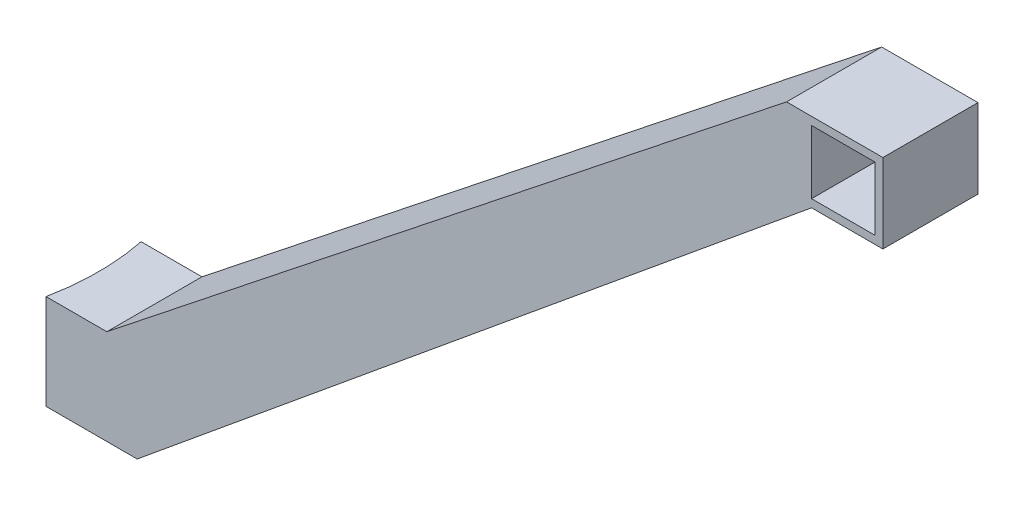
ISO-10303-21;
HEADER;
FILE_DESCRIPTION(('STEP AP214'),'2;1');
FILE_NAME('part.step','',(''),(''),'','','');
FILE_SCHEMA(('AUTOMOTIVE_DESIGN { 1 0 10303 214 1 1 1 1 }'));
ENDSEC;
DATA;
#1=APPLICATION_CONTEXT('core data for automotive mechanical design processes');
#2=APPLICATION_PROTOCOL_DEFINITION('international standard','automotive_design',2000,#1);
#3=PRODUCT_CONTEXT('',#1,'mechanical');
#4=PRODUCT('Part','Part','',(#3));
#5=PRODUCT_RELATED_PRODUCT_CATEGORY('part','',(#4));
#6=PRODUCT_DEFINITION_FORMATION('','',#4);
#7=PRODUCT_DEFINITION_CONTEXT('part definition',#1,'design');
#8=PRODUCT_DEFINITION('design','',#6,#7);
#9=PRODUCT_DEFINITION_SHAPE('','',#8);
#10=(LENGTH_UNIT() NAMED_UNIT(*) SI_UNIT(.MILLI.,.METRE.));
#11=(NAMED_UNIT(*) PLANE_ANGLE_UNIT() SI_UNIT($,.RADIAN.));
#12=(NAMED_UNIT(*) SI_UNIT($,.STERADIAN.) SOLID_ANGLE_UNIT());
#13=UNCERTAINTY_MEASURE_WITH_UNIT(LENGTH_MEASURE(1.E-05),#10,'distance_accuracy_value','');
#14=(GEOMETRIC_REPRESENTATION_CONTEXT(3) GLOBAL_UNCERTAINTY_ASSIGNED_CONTEXT((#13)) GLOBAL_UNIT_ASSIGNED_CONTEXT((#10,
#11,#12)) REPRESENTATION_CONTEXT('',''));
#15=CARTESIAN_POINT('',(0.,0.,0.));
#16=DIRECTION('',(0.,0.,1.));
#17=DIRECTION('',(1.,0.,0.));
#18=AXIS2_PLACEMENT_3D('',#15,#16,#17);
#19=CARTESIAN_POINT('',(257.5,0.,30.));
#20=DIRECTION('',(-1.,0.,0.));
#21=DIRECTION('',(0.,0.,1.));
#22=AXIS2_PLACEMENT_3D('',#19,#20,#21);
#23=PLANE('',#22);
#24=DIRECTION('',(0.,1.,0.));
#25=VECTOR('',#24,1.);
#26=CARTESIAN_POINT('',(257.5,0.,0.));
#27=LINE('',#26,#25);
#28=CARTESIAN_POINT('',(257.5,145.,0.));
#29=VERTEX_POINT('',#28);
#30=CARTESIAN_POINT('',(257.5,170.,0.));
#31=VERTEX_POINT('',#30);
#32=EDGE_CURVE('E177',#29,#31,#27,.T.);
#33=ORIENTED_EDGE('',*,*,#32,.T.);
#34=DIRECTION('',(0.,0.,-1.));
#35=VECTOR('',#34,1.);
#36=CARTESIAN_POINT('',(257.5,170.,30.));
#37=LINE('',#36,#35);
#38=CARTESIAN_POINT('',(257.5,170.,30.));
#39=VERTEX_POINT('',#38);
#40=EDGE_CURVE('E50',#39,#31,#37,.T.);
#41=ORIENTED_EDGE('',*,*,#40,.F.);
#42=DIRECTION('',(0.,1.,0.));
#43=VECTOR('',#42,1.);
#44=CARTESIAN_POINT('',(257.5,0.,30.));
#45=LINE('',#44,#43);
#46=CARTESIAN_POINT('',(257.5,145.,30.));
#47=VERTEX_POINT('',#46);
#48=EDGE_CURVE('E231',#47,#39,#45,.T.);
#49=ORIENTED_EDGE('',*,*,#48,.F.);
#50=DIRECTION('',(0.,0.,-1.));
#51=VECTOR('',#50,1.);
#52=CARTESIAN_POINT('',(257.5,145.,30.));
#53=LINE('',#52,#51);
#54=EDGE_CURVE('E192',#47,#29,#53,.T.);
#55=ORIENTED_EDGE('',*,*,#54,.T.);
#56=EDGE_LOOP('',(#33,#41,#49,#55));
#57=FACE_BOUND('',#56,.T.);
#58=ADVANCED_FACE('F42',(#57),#23,.F.);
#59=CARTESIAN_POINT('',(0.,170.,30.));
#60=DIRECTION('',(0.,-1.,0.));
#61=DIRECTION('',(0.,0.,-1.));
#62=AXIS2_PLACEMENT_3D('',#59,#60,#61);
#63=PLANE('',#62);
#64=DIRECTION('',(-1.,0.,0.));
#65=VECTOR('',#64,1.);
#66=CARTESIAN_POINT('',(0.,170.,0.));
#67=LINE('',#66,#65);
#68=CARTESIAN_POINT('',(227.104035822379,170.,0.));
#69=VERTEX_POINT('',#68);
#70=EDGE_CURVE('E180',#31,#69,#67,.T.);
#71=ORIENTED_EDGE('',*,*,#70,.T.);
#72=DIRECTION('',(0.,0.,-1.));
#73=VECTOR('',#72,1.);
#74=CARTESIAN_POINT('',(227.104035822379,170.,30.));
#75=LINE('',#74,#73);
#76=CARTESIAN_POINT('',(227.104035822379,170.,30.));
#77=VERTEX_POINT('',#76);
#78=EDGE_CURVE('E197',#77,#69,#75,.T.);
#79=ORIENTED_EDGE('',*,*,#78,.F.);
#80=DIRECTION('',(-1.,0.,0.));
#81=VECTOR('',#80,1.);
#82=CARTESIAN_POINT('',(0.,170.,30.));
#83=LINE('',#82,#81);
#84=EDGE_CURVE('E233',#39,#77,#83,.T.);
#85=ORIENTED_EDGE('',*,*,#84,.F.);
#86=ORIENTED_EDGE('',*,*,#40,.T.);
#87=EDGE_LOOP('',(#71,#79,#85,#86));
#88=FACE_BOUND('',#87,.T.);
#89=ADVANCED_FACE('F263',(#88),#63,.F.);
#90=CARTESIAN_POINT('',(4.89454860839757,-6.17354405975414,30.));
#91=DIRECTION('',(0.621261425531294,-0.783603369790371,0.));
#92=DIRECTION('',(0.783603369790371,0.621261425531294,0.));
#93=AXIS2_PLACEMENT_3D('',#90,#91,#92);
#94=PLANE('',#93);
#95=DIRECTION('',(-0.783603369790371,-0.621261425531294,0.));
#96=VECTOR('',#95,1.);
#97=CARTESIAN_POINT('',(4.89454860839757,-6.17354405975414,0.));
#98=LINE('',#97,#96);
#99=CARTESIAN_POINT('',(12.6813026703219,0.,0.));
#100=VERTEX_POINT('',#99);
#101=EDGE_CURVE('E182',#69,#100,#98,.T.);
#102=ORIENTED_EDGE('',*,*,#101,.T.);
#103=DIRECTION('',(0.,0.,-1.));
#104=VECTOR('',#103,1.);
#105=CARTESIAN_POINT('',(12.6813026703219,0.,30.));
#106=LINE('',#105,#104);
#107=CARTESIAN_POINT('',(12.6813026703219,0.,30.));
#108=VERTEX_POINT('',#107);
#109=EDGE_CURVE('E156',#108,#100,#106,.T.);
#110=ORIENTED_EDGE('',*,*,#109,.F.);
#111=DIRECTION('',(-0.783603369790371,-0.621261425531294,0.));
#112=VECTOR('',#111,1.);
#113=CARTESIAN_POINT('',(4.89454860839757,-6.17354405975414,30.));
#114=LINE('',#113,#112);
#115=EDGE_CURVE('E235',#77,#108,#114,.T.);
#116=ORIENTED_EDGE('',*,*,#115,.F.);
#117=ORIENTED_EDGE('',*,*,#78,.T.);
#118=EDGE_LOOP('',(#102,#110,#116,#117));
#119=FACE_BOUND('',#118,.T.);
#120=ADVANCED_FACE('F245',(#119),#94,.F.);
#121=CARTESIAN_POINT('',(0.,0.,30.));
#122=DIRECTION('',(0.,1.,0.));
#123=DIRECTION('',(0.,0.,1.));
#124=AXIS2_PLACEMENT_3D('',#121,#122,#123);
#125=PLANE('',#124);
#126=CARTESIAN_POINT('',(-80.,0.,15.));
#127=DIRECTION('',(0.,1.,0.));
#128=DIRECTION('',(0.,0.,1.));
#129=AXIS2_PLACEMENT_3D('',#126,#127,#128);
#130=CIRCLE('',#129,75.);
#131=CARTESIAN_POINT('',(-6.51530771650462,0.,30.));
#132=VERTEX_POINT('',#131);
#133=CARTESIAN_POINT('',(-6.51530771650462,0.,0.));
#134=VERTEX_POINT('',#133);
#135=EDGE_CURVE('E57',#132,#134,#130,.T.);
#136=ORIENTED_EDGE('',*,*,#135,.F.);
#137=DIRECTION('',(1.,0.,0.));
#138=VECTOR('',#137,1.);
#139=CARTESIAN_POINT('',(0.,0.,30.));
#140=LINE('',#139,#138);
#141=EDGE_CURVE('E147',#132,#108,#140,.T.);
#142=ORIENTED_EDGE('',*,*,#141,.T.);
#143=ORIENTED_EDGE('',*,*,#109,.T.);
#144=DIRECTION('',(1.,0.,0.));
#145=VECTOR('',#144,1.);
#146=CARTESIAN_POINT('',(0.,0.,0.));
#147=LINE('',#146,#145);
#148=EDGE_CURVE('E185',#134,#100,#147,.T.);
#149=ORIENTED_EDGE('',*,*,#148,.F.);
#150=EDGE_LOOP('',(#136,#142,#143,#149));
#151=FACE_BOUND('',#150,.T.);
#152=ADVANCED_FACE('F238',(#151),#125,.T.);
#153=CARTESIAN_POINT('',(0.,-30.,30.));
#154=DIRECTION('',(0.,1.,0.));
#155=DIRECTION('',(0.,0.,1.));
#156=AXIS2_PLACEMENT_3D('',#153,#154,#155);
#157=PLANE('',#156);
#158=DIRECTION('',(1.,0.,0.));
#159=VECTOR('',#158,1.);
#160=CARTESIAN_POINT('',(0.,-30.,30.));
#161=LINE('',#160,#159);
#162=CARTESIAN_POINT('',(-6.51530771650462,-30.,30.));
#163=VERTEX_POINT('',#162);
#164=CARTESIAN_POINT('',(22.2480376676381,-30.,30.));
#165=VERTEX_POINT('',#164);
#166=EDGE_CURVE('E136',#163,#165,#161,.T.);
#167=ORIENTED_EDGE('',*,*,#166,.F.);
#168=CARTESIAN_POINT('',(-80.,-30.,15.));
#169=DIRECTION('',(0.,1.,0.));
#170=DIRECTION('',(0.,0.,1.));
#171=AXIS2_PLACEMENT_3D('',#168,#169,#170);
#172=CIRCLE('',#171,75.);
#173=CARTESIAN_POINT('',(-6.51530771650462,-30.,0.));
#174=VERTEX_POINT('',#173);
#175=EDGE_CURVE('E251',#163,#174,#172,.T.);
#176=ORIENTED_EDGE('',*,*,#175,.T.);
#177=DIRECTION('',(1.,0.,0.));
#178=VECTOR('',#177,1.);
#179=CARTESIAN_POINT('',(0.,-30.,0.));
#180=LINE('',#179,#178);
#181=CARTESIAN_POINT('',(22.2480376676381,-30.,0.));
#182=VERTEX_POINT('',#181);
#183=EDGE_CURVE('E153',#174,#182,#180,.T.);
#184=ORIENTED_EDGE('',*,*,#183,.T.);
#185=DIRECTION('',(0.,0.,-1.));
#186=VECTOR('',#185,1.);
#187=CARTESIAN_POINT('',(22.2480376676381,-30.,30.));
#188=LINE('',#187,#186);
#189=EDGE_CURVE('E150',#165,#182,#188,.T.);
#190=ORIENTED_EDGE('',*,*,#189,.F.);
#191=EDGE_LOOP('',(#167,#176,#184,#190));
#192=FACE_BOUND('',#191,.T.);
#193=ADVANCED_FACE('F151',(#192),#157,.F.);
#194=CARTESIAN_POINT('',(23.69655989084,-28.8085120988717,30.));
#195=DIRECTION('',(-0.63525831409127,0.772299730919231,0.));
#196=DIRECTION('',(-0.772299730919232,-0.63525831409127,0.));
#197=AXIS2_PLACEMENT_3D('',#194,#195,#196);
#198=PLANE('',#197);
#199=DIRECTION('',(0.772299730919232,0.63525831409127,0.));
#200=VECTOR('',#199,1.);
#201=CARTESIAN_POINT('',(23.69655989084,-28.8085120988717,0.));
#202=LINE('',#201,#200);
#203=CARTESIAN_POINT('',(235.,145.,0.));
#204=VERTEX_POINT('',#203);
#205=EDGE_CURVE('E188',#182,#204,#202,.T.);
#206=ORIENTED_EDGE('',*,*,#205,.T.);
#207=DIRECTION('',(0.,0.,-1.));
#208=VECTOR('',#207,1.);
#209=CARTESIAN_POINT('',(235.,145.,30.));
#210=LINE('',#209,#208);
#211=CARTESIAN_POINT('',(235.,145.,30.));
#212=VERTEX_POINT('',#211);
#213=EDGE_CURVE('E157',#212,#204,#210,.T.);
#214=ORIENTED_EDGE('',*,*,#213,.F.);
#215=DIRECTION('',(0.772299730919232,0.63525831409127,0.));
#216=VECTOR('',#215,1.);
#217=CARTESIAN_POINT('',(23.69655989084,-28.8085120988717,30.));
#218=LINE('',#217,#216);
#219=EDGE_CURVE('E141',#165,#212,#218,.T.);
#220=ORIENTED_EDGE('',*,*,#219,.F.);
#221=ORIENTED_EDGE('',*,*,#189,.T.);
#222=EDGE_LOOP('',(#206,#214,#220,#221));
#223=FACE_BOUND('',#222,.T.);
#224=ADVANCED_FACE('F159',(#223),#198,.F.);
#225=CARTESIAN_POINT('',(0.,167.5,30.));
#226=DIRECTION('',(0.,-1.,0.));
#227=DIRECTION('',(0.,0.,-1.));
#228=AXIS2_PLACEMENT_3D('',#225,#226,#227);
#229=PLANE('',#228);
#230=DIRECTION('',(-1.,0.,0.));
#231=VECTOR('',#230,1.);
#232=CARTESIAN_POINT('',(0.,167.5,0.));
#233=LINE('',#232,#231);
#234=CARTESIAN_POINT('',(255.,167.5,0.));
#235=VERTEX_POINT('',#234);
#236=CARTESIAN_POINT('',(235.,167.5,0.));
#237=VERTEX_POINT('',#236);
#238=EDGE_CURVE('E165',#235,#237,#233,.T.);
#239=ORIENTED_EDGE('',*,*,#238,.F.);
#240=DIRECTION('',(0.,0.,-1.));
#241=VECTOR('',#240,1.);
#242=CARTESIAN_POINT('',(255.,167.5,30.));
#243=LINE('',#242,#241);
#244=CARTESIAN_POINT('',(255.,167.5,30.));
#245=VERTEX_POINT('',#244);
#246=EDGE_CURVE('E112',#245,#235,#243,.T.);
#247=ORIENTED_EDGE('',*,*,#246,.F.);
#248=DIRECTION('',(-1.,0.,0.));
#249=VECTOR('',#248,1.);
#250=CARTESIAN_POINT('',(0.,167.5,30.));
#251=LINE('',#250,#249);
#252=CARTESIAN_POINT('',(235.,167.5,30.));
#253=VERTEX_POINT('',#252);
#254=EDGE_CURVE('E191',#245,#253,#251,.T.);
#255=ORIENTED_EDGE('',*,*,#254,.T.);
#256=DIRECTION('',(0.,0.,-1.));
#257=VECTOR('',#256,1.);
#258=CARTESIAN_POINT('',(235.,167.5,30.));
#259=LINE('',#258,#257);
#260=EDGE_CURVE('E161',#253,#237,#259,.T.);
#261=ORIENTED_EDGE('',*,*,#260,.T.);
#262=EDGE_LOOP('',(#239,#247,#255,#261));
#263=FACE_BOUND('',#262,.T.);
#264=ADVANCED_FACE('F44',(#263),#229,.T.);
#265=CARTESIAN_POINT('',(255.,0.,30.));
#266=DIRECTION('',(-1.,0.,0.));
#267=DIRECTION('',(0.,0.,1.));
#268=AXIS2_PLACEMENT_3D('',#265,#266,#267);
#269=PLANE('',#268);
#270=DIRECTION('',(0.,1.,0.));
#271=VECTOR('',#270,1.);
#272=CARTESIAN_POINT('',(255.,0.,0.));
#273=LINE('',#272,#271);
#274=CARTESIAN_POINT('',(255.,147.5,0.));
#275=VERTEX_POINT('',#274);
#276=EDGE_CURVE('E168',#275,#235,#273,.T.);
#277=ORIENTED_EDGE('',*,*,#276,.F.);
#278=DIRECTION('',(0.,0.,-1.));
#279=VECTOR('',#278,1.);
#280=CARTESIAN_POINT('',(255.,147.5,30.));
#281=LINE('',#280,#279);
#282=CARTESIAN_POINT('',(255.,147.5,30.));
#283=VERTEX_POINT('',#282);
#284=EDGE_CURVE('E205',#283,#275,#281,.T.);
#285=ORIENTED_EDGE('',*,*,#284,.F.);
#286=DIRECTION('',(0.,1.,0.));
#287=VECTOR('',#286,1.);
#288=CARTESIAN_POINT('',(255.,0.,30.));
#289=LINE('',#288,#287);
#290=EDGE_CURVE('E211',#283,#245,#289,.T.);
#291=ORIENTED_EDGE('',*,*,#290,.T.);
#292=ORIENTED_EDGE('',*,*,#246,.T.);
#293=EDGE_LOOP('',(#277,#285,#291,#292));
#294=FACE_BOUND('',#293,.T.);
#295=ADVANCED_FACE('F209',(#294),#269,.T.);
#296=CARTESIAN_POINT('',(0.,147.5,30.));
#297=DIRECTION('',(0.,1.,0.));
#298=DIRECTION('',(0.,0.,1.));
#299=AXIS2_PLACEMENT_3D('',#296,#297,#298);
#300=PLANE('',#299);
#301=DIRECTION('',(1.,0.,0.));
#302=VECTOR('',#301,1.);
#303=CARTESIAN_POINT('',(0.,147.5,0.));
#304=LINE('',#303,#302);
#305=CARTESIAN_POINT('',(235.,147.5,0.));
#306=VERTEX_POINT('',#305);
#307=EDGE_CURVE('E171',#306,#275,#304,.T.);
#308=ORIENTED_EDGE('',*,*,#307,.F.);
#309=DIRECTION('',(0.,0.,-1.));
#310=VECTOR('',#309,1.);
#311=CARTESIAN_POINT('',(235.,147.5,30.));
#312=LINE('',#311,#310);
#313=CARTESIAN_POINT('',(235.,147.5,30.));
#314=VERTEX_POINT('',#313);
#315=EDGE_CURVE('E203',#314,#306,#312,.T.);
#316=ORIENTED_EDGE('',*,*,#315,.F.);
#317=DIRECTION('',(1.,0.,0.));
#318=VECTOR('',#317,1.);
#319=CARTESIAN_POINT('',(0.,147.5,30.));
#320=LINE('',#319,#318);
#321=EDGE_CURVE('E223',#314,#283,#320,.T.);
#322=ORIENTED_EDGE('',*,*,#321,.T.);
#323=ORIENTED_EDGE('',*,*,#284,.T.);
#324=EDGE_LOOP('',(#308,#316,#322,#323));
#325=FACE_BOUND('',#324,.T.);
#326=ADVANCED_FACE('F219',(#325),#300,.T.);
#327=CARTESIAN_POINT('',(235.,0.,30.));
#328=DIRECTION('',(-1.,0.,0.));
#329=DIRECTION('',(0.,0.,1.));
#330=AXIS2_PLACEMENT_3D('',#327,#328,#329);
#331=PLANE('',#330);
#332=DIRECTION('',(0.,1.,0.));
#333=VECTOR('',#332,1.);
#334=CARTESIAN_POINT('',(235.,0.,0.));
#335=LINE('',#334,#333);
#336=EDGE_CURVE('E174',#306,#237,#335,.T.);
#337=ORIENTED_EDGE('',*,*,#336,.T.);
#338=ORIENTED_EDGE('',*,*,#260,.F.);
#339=DIRECTION('',(0.,1.,0.));
#340=VECTOR('',#339,1.);
#341=CARTESIAN_POINT('',(235.,0.,30.));
#342=LINE('',#341,#340);
#343=EDGE_CURVE('E225',#314,#253,#342,.T.);
#344=ORIENTED_EDGE('',*,*,#343,.F.);
#345=ORIENTED_EDGE('',*,*,#315,.T.);
#346=EDGE_LOOP('',(#337,#338,#344,#345));
#347=FACE_BOUND('',#346,.T.);
#348=ADVANCED_FACE('F273',(#347),#331,.F.);
#349=CARTESIAN_POINT('',(0.,145.,30.));
#350=DIRECTION('',(0.,1.,0.));
#351=DIRECTION('',(0.,0.,1.));
#352=AXIS2_PLACEMENT_3D('',#349,#350,#351);
#353=PLANE('',#352);
#354=DIRECTION('',(1.,0.,0.));
#355=VECTOR('',#354,1.);
#356=CARTESIAN_POINT('',(0.,145.,0.));
#357=LINE('',#356,#355);
#358=EDGE_CURVE('E104',#204,#29,#357,.T.);
#359=ORIENTED_EDGE('',*,*,#358,.T.);
#360=ORIENTED_EDGE('',*,*,#54,.F.);
#361=DIRECTION('',(1.,0.,0.));
#362=VECTOR('',#361,1.);
#363=CARTESIAN_POINT('',(0.,145.,30.));
#364=LINE('',#363,#362);
#365=EDGE_CURVE('E65',#212,#47,#364,.T.);
#366=ORIENTED_EDGE('',*,*,#365,.F.);
#367=ORIENTED_EDGE('',*,*,#213,.T.);
#368=EDGE_LOOP('',(#359,#360,#366,#367));
#369=FACE_BOUND('',#368,.T.);
#370=ADVANCED_FACE('F276',(#369),#353,.F.);
#371=CARTESIAN_POINT('',(0.,0.,30.));
#372=DIRECTION('',(0.,0.,1.));
#373=DIRECTION('',(1.,0.,0.));
#374=AXIS2_PLACEMENT_3D('',#371,#372,#373);
#375=PLANE('',#374);
#376=DIRECTION('',(0.,1.,0.));
#377=VECTOR('',#376,1.);
#378=CARTESIAN_POINT('',(-6.51530771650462,-36.,30.));
#379=LINE('',#378,#377);
#380=EDGE_CURVE('E144',#163,#132,#379,.T.);
#381=ORIENTED_EDGE('',*,*,#380,.F.);
#382=ORIENTED_EDGE('',*,*,#166,.T.);
#383=ORIENTED_EDGE('',*,*,#219,.T.);
#384=ORIENTED_EDGE('',*,*,#365,.T.);
#385=ORIENTED_EDGE('',*,*,#48,.T.);
#386=ORIENTED_EDGE('',*,*,#84,.T.);
#387=ORIENTED_EDGE('',*,*,#115,.T.);
#388=ORIENTED_EDGE('',*,*,#141,.F.);
#389=EDGE_LOOP('',(#381,#382,#383,#384,#385,#386,#387,#388));
#390=FACE_BOUND('',#389,.T.);
#391=ORIENTED_EDGE('',*,*,#254,.F.);
#392=ORIENTED_EDGE('',*,*,#290,.F.);
#393=ORIENTED_EDGE('',*,*,#321,.F.);
#394=ORIENTED_EDGE('',*,*,#343,.T.);
#395=EDGE_LOOP('',(#391,#392,#393,#394));
#396=FACE_BOUND('',#395,.T.);
#397=ADVANCED_FACE('F138',(#390,#396),#375,.T.);
#398=CARTESIAN_POINT('',(0.,0.,0.));
#399=DIRECTION('',(0.,0.,1.));
#400=DIRECTION('',(1.,0.,0.));
#401=AXIS2_PLACEMENT_3D('',#398,#399,#400);
#402=PLANE('',#401);
#403=ORIENTED_EDGE('',*,*,#238,.T.);
#404=ORIENTED_EDGE('',*,*,#336,.F.);
#405=ORIENTED_EDGE('',*,*,#307,.T.);
#406=ORIENTED_EDGE('',*,*,#276,.T.);
#407=EDGE_LOOP('',(#403,#404,#405,#406));
#408=FACE_BOUND('',#407,.T.);
#409=ORIENTED_EDGE('',*,*,#183,.F.);
#410=DIRECTION('',(0.,1.,0.));
#411=VECTOR('',#410,1.);
#412=CARTESIAN_POINT('',(-6.51530771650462,-36.,0.));
#413=LINE('',#412,#411);
#414=EDGE_CURVE('E11',#174,#134,#413,.T.);
#415=ORIENTED_EDGE('',*,*,#414,.T.);
#416=ORIENTED_EDGE('',*,*,#148,.T.);
#417=ORIENTED_EDGE('',*,*,#101,.F.);
#418=ORIENTED_EDGE('',*,*,#70,.F.);
#419=ORIENTED_EDGE('',*,*,#32,.F.);
#420=ORIENTED_EDGE('',*,*,#358,.F.);
#421=ORIENTED_EDGE('',*,*,#205,.F.);
#422=EDGE_LOOP('',(#409,#415,#416,#417,#418,#419,#420,#421));
#423=FACE_BOUND('',#422,.T.);
#424=ADVANCED_FACE('F215',(#408,#423),#402,.F.);
#425=CARTESIAN_POINT('',(-80.,-36.,15.));
#426=DIRECTION('',(0.,1.,0.));
#427=DIRECTION('',(0.,0.,1.));
#428=AXIS2_PLACEMENT_3D('',#425,#426,#427);
#429=CYLINDRICAL_SURFACE('',#428,75.);
#430=ORIENTED_EDGE('',*,*,#380,.T.);
#431=ORIENTED_EDGE('',*,*,#135,.T.);
#432=ORIENTED_EDGE('',*,*,#414,.F.);
#433=ORIENTED_EDGE('',*,*,#175,.F.);
#434=EDGE_LOOP('',(#430,#431,#432,#433));
#435=FACE_BOUND('',#434,.T.);
#436=ADVANCED_FACE('F250',(#435),#429,.F.);
#437=CLOSED_SHELL('',(#58,#89,#120,#152,#193,#224,#264,#295,#326,#348,#370,#397,#424,#436));
#438=MANIFOLD_SOLID_BREP('B2',#437);
#439=ADVANCED_BREP_SHAPE_REPRESENTATION('',(#18,#438),#14);
#440=SHAPE_DEFINITION_REPRESENTATION(#9,#439);
ENDSEC;
END-ISO-10303-21;
